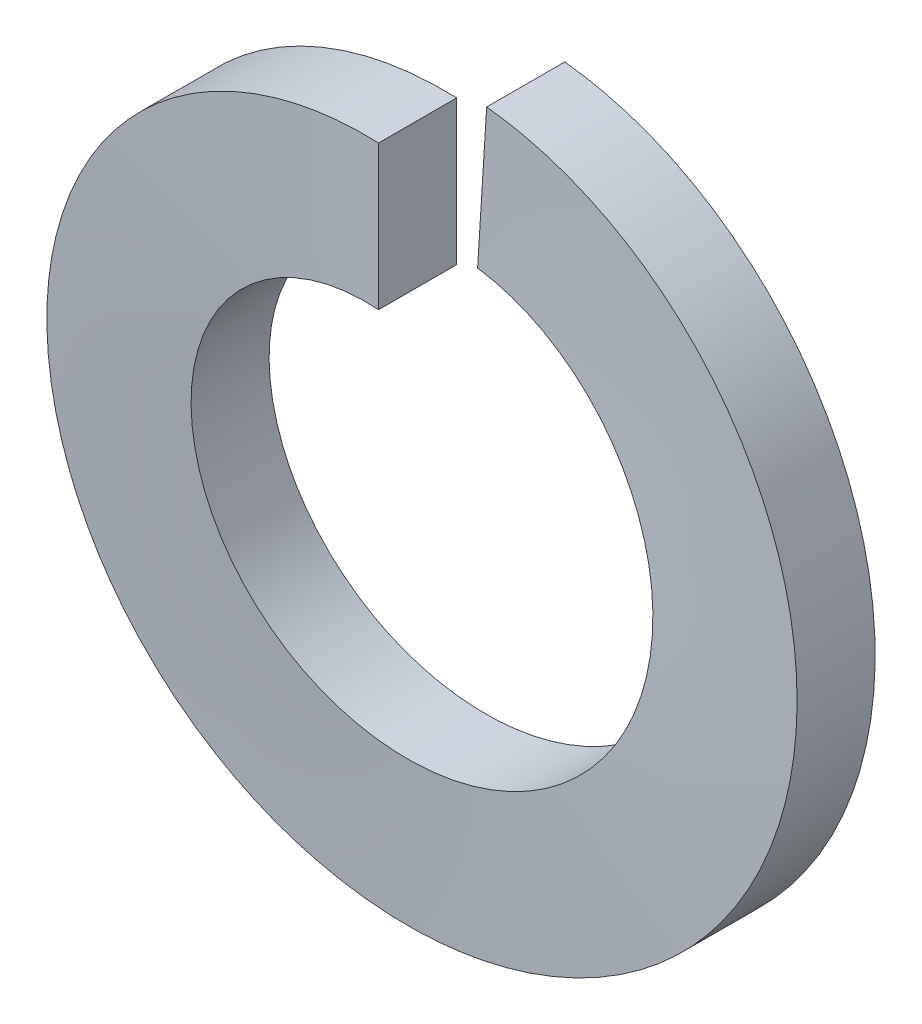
from build123d import *

# Parameters (mm, degrees)
SWEEP1_PITCH       = 2.222222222
SWEEP1_HEIGHT      = 2.2
SWEEP1_RADIUS      = 9.05
SWEEP1_START_ANGLE = 90
SKETCH2_W          = 2
SKETCH2_H          = 3.7


with BuildPart() as part:
    # Sweep1: sweep along a helix
    with BuildLine() as sweep1_path:
        add(Helix(SWEEP1_PITCH, SWEEP1_HEIGHT, SWEEP1_RADIUS, center=(0, 0, 0), direction=(0, 0, -1), lefthand=True, mode=Mode.PRIVATE).rotate(Axis((0, 0, 0), (0, 0, -1)), SWEEP1_START_ANGLE))
    # Sketch2 → Sweep1 (sweep)
    with BuildSketch(Plane(origin=(0, 0, 0), x_dir=(0, 0, -1), z_dir=(1, 0, 0))):
        with Locations((-1, 7.2)):
            Rectangle(SKETCH2_W, SKETCH2_H)
    sweep(path=sweep1_path.line, is_frenet=True)


solid = part.part
